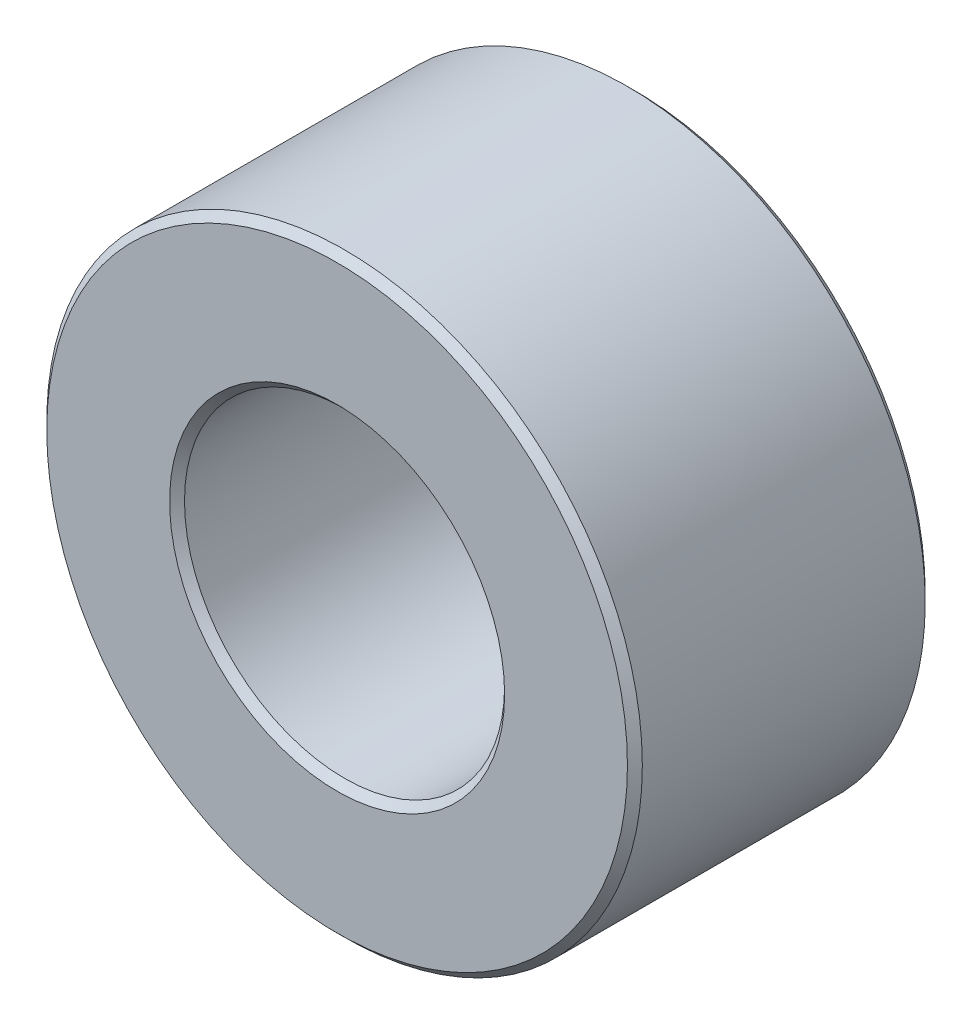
from build123d import *

# Parameters (mm, degrees)
SKETCH1_R           = 4
SKETCH1_R_2         = 2.15
BOSS_EXTRUDE2_DEPTH = 2
CHAMFER3_SIZE       = 0.1


with BuildPart() as part:
    # Sketch1 → Boss-Extrude2 (new, symmetric)
    with BuildSketch(Plane.XY):
        Circle(SKETCH1_R)
        Circle(SKETCH1_R_2, mode=Mode.SUBTRACT)
    extrude(amount=BOSS_EXTRUDE2_DEPTH, both=True)

    # Chamfer3
    chamfer3_edges = [part.edges().sort_by_distance(p)[0] for p in [
        (-4, 0, -2),
        (-4, 0, 2),
        (-2.15, 0, -2),
        (-2.15, 0, 2),
    ]]
    chamfer(chamfer3_edges, length=CHAMFER3_SIZE)


solid = part.part
